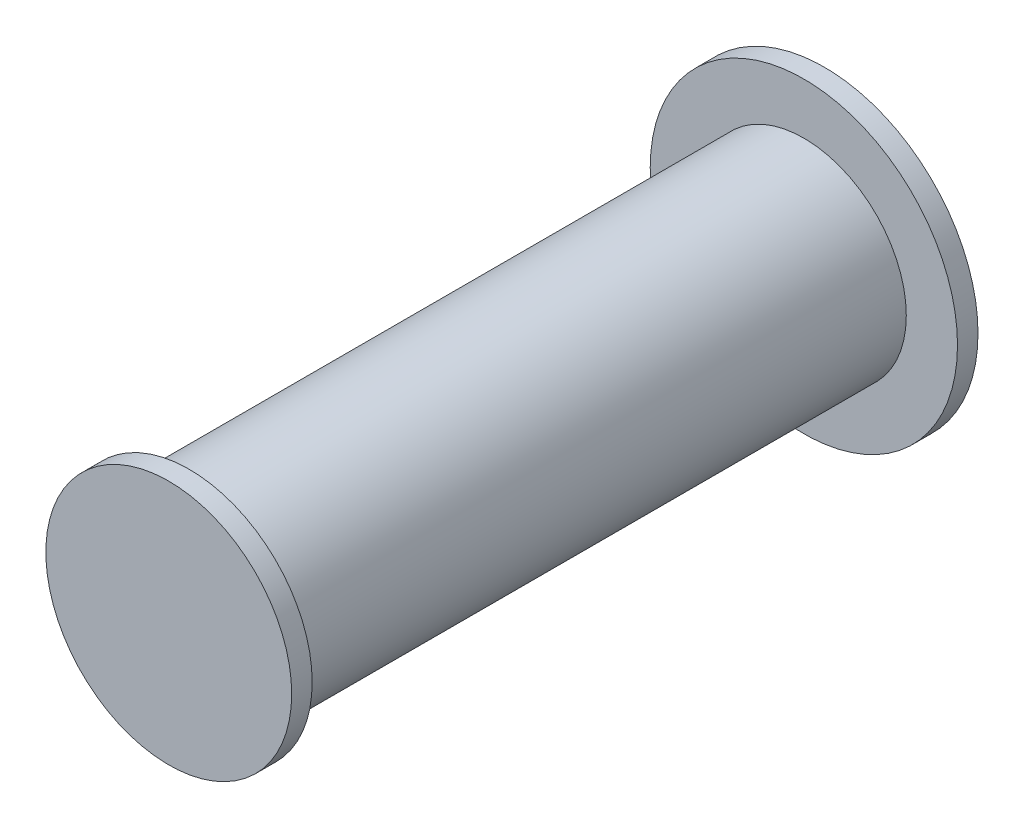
from build123d import *

# Parameters (mm, degrees)
SKETCH1_R           = 75
BOSS_EXTRUDE1_DEPTH = 10
SKETCH2_R           = 50
BOSS_EXTRUDE2_DEPTH = 300
SKETCH3_R           = 60
BOSS_EXTRUDE3_DEPTH = 10


with BuildPart() as part:
    # Sketch1 → Boss-Extrude1 (new body)
    with BuildSketch(Plane.XY):
        Circle(SKETCH1_R)
    extrude(amount=BOSS_EXTRUDE1_DEPTH)

    # Sketch2 → Boss-Extrude2 (add)
    with BuildSketch(Plane.XY.offset(10)):
        Circle(SKETCH2_R)
    extrude(amount=BOSS_EXTRUDE2_DEPTH)

    # Sketch3 → Boss-Extrude3 (add)
    with BuildSketch(Plane.XY.offset(310)):
        Circle(SKETCH3_R)
    extrude(amount=BOSS_EXTRUDE3_DEPTH)


solid = part.part
